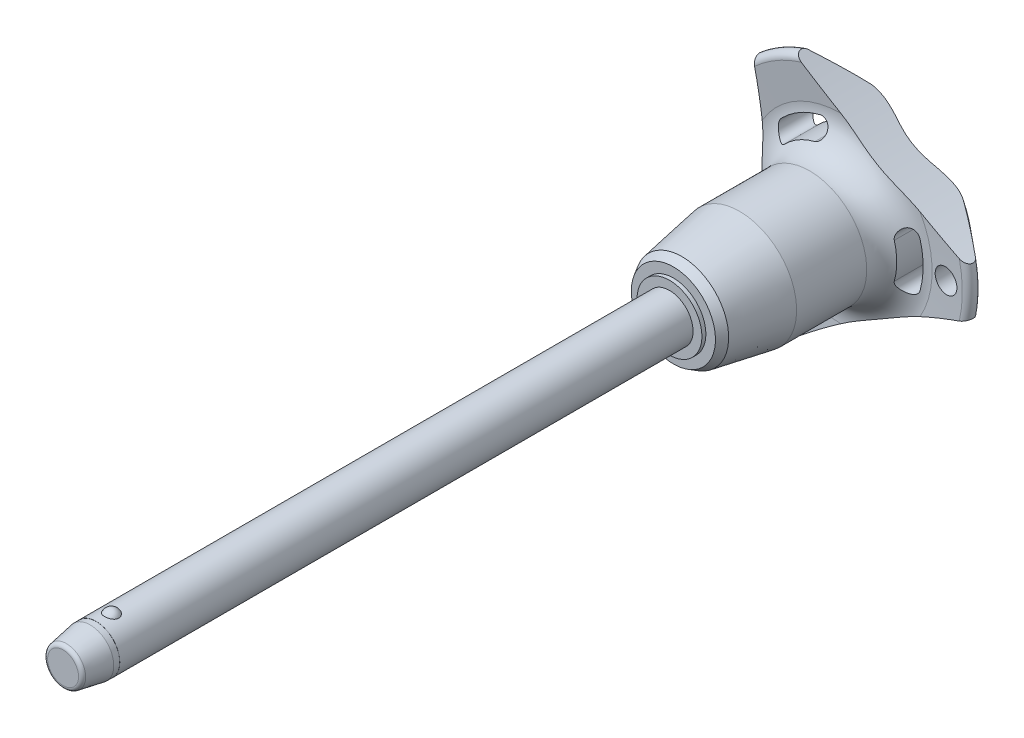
from build123d import *

# Parameters (mm, degrees)
SKETCH1_R           = 3
BOSS_EXTRUDE1_DEPTH = 70
SKETCH2_R           = 2.5
BOSS_EXTRUDE2_DEPTH = 26.7
BOSS_EXTRUDE3_START = 7
SKETCH1_2_R         = 3
BOSS_EXTRUDE3_DEPTH = 7
CHAMFER1_SIZE       = 3.5
CHAMFER1_SIZE2      = 0.617144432
FILLET1_R           = 0.5
SKETCH6_R           = 79.96
CUT_EXTRUDE1_DEPTH  = 100.509565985
CIRPATTERN1_COUNT   = 3
SKETCH7_R           = 1.5
CUT_EXTRUDE2_DEPTH  = 100.35648861
SKETCH8_R           = 3
SKETCH8_R_2         = 2.99
CUT_EXTRUDE3_DEPTH  = 4.2


with BuildPart() as part:
    # Sketch1 → Boss-Extrude1 (new body)
    with BuildSketch(Plane.XY):
        Circle(SKETCH1_R)
    extrude(amount=-BOSS_EXTRUDE1_DEPTH)

    # Sketch2 → Boss-Extrude2 (add)
    with BuildSketch(Plane(origin=(0, 0, -70), x_dir=(-1, 0, 0), z_dir=(0, 0, -1))):
        Circle(SKETCH2_R)
    extrude(amount=BOSS_EXTRUDE2_DEPTH)

    # Sketch3 → Revolve1 (revolve)
    with BuildSketch(Plane(origin=(0, 0, 0), x_dir=(0, 0, -1), z_dir=(1, 0, 0))):
        with BuildLine():
            Line((-0.866025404, 3.5), (-0.866025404, 1.5))
            ThreePointArc((-0.866025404, 1.5), (0.133974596, 2.5), (-0.866025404, 3.5))
        make_face()
        with BuildLine():
            Line((-0.866025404, -1.5), (-0.866025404, -3.5))
            ThreePointArc((-0.866025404, -3.5), (0.133974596, -2.5), (-0.866025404, -1.5))
        make_face()
    revolve(axis=Axis((0, -1.5, 0.866025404), (0, 1, 0)))

    # Sketch1_2 → Boss-Extrude3 (add)
    with BuildSketch(Plane.XY.offset(BOSS_EXTRUDE3_START)):
        Circle(SKETCH1_2_R)
    extrude(amount=-BOSS_EXTRUDE3_DEPTH)

    # Chamfer1
    chamfer1_edges = [part.edges().sort_by_distance(p)[0] for p in [
        (-3, 0, 7),
    ]]
    chamfer1_side = [part.faces().sort_by_distance(p)[0] for p in [
        (-3, 0, -31.5),
    ]]
    chamfer(chamfer1_edges, length=CHAMFER1_SIZE, length2=CHAMFER1_SIZE2, reference=chamfer1_side[0])

    # Fillet1
    fillet1_edges = [part.edges().sort_by_distance(p)[0] for p in [
        (-2.382855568, 0, 7),
        (2.5, 0, -96.7),
    ]]
    fillet(fillet1_edges, radius=FILLET1_R)

    # Sketch4 → Revolve2 (revolve)
    with BuildSketch(Plane(origin=(0, 0, 0), x_dir=(0, 0, -1), z_dir=(1, 0, 0)), mode=Mode.PRIVATE) as revolve2_sk:
        Polygon((70, 0), (70, 4.118359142), (70.5, 4.118359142), (70.5, 5.343400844), (71.560917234, 5.955921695), (78.9, 7.25), (87.8, 7.25), (87.8, 0), align=None)
    revolve(revolve2_sk.sketch.rotate(Axis((0, 0, -87.8), (0, 0, 1)), 90), axis=Axis((0, 0, -87.8), (0, 0, 1)))

    # Sketch5 → Revolve3 (revolve)
    with BuildSketch(Plane(origin=(0, 0, 0), x_dir=(0, 0, -1), z_dir=(1, 0, 0)), mode=Mode.PRIVATE) as revolve3_sk:
        with BuildLine():
            Line((91.78715932, 11.570250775), (91.452568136, 15.735949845))
            ThreePointArc((91.452568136, 15.735949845), (91.946485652, 16.540188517), (92.862835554, 16.314230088))
            Line((92.862835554, 16.314230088), (96.326414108, 12.186497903))
            ThreePointArc((96.326414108, 12.186497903), (96.7, 11.109282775), (96.261488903, 10.056825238))
            ThreePointArc((96.261488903, 10.056825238), (93.289873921, 5.413681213), (92.25, 0))
            Line((92.25, 0), (87.8, 0))
            Line((87.8, 0), (87.8, 7.25))
            ThreePointArc((87.8, 7.25), (90.739473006, 8.537160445), (91.78715932, 11.570250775))
        make_face()
    revolve(revolve3_sk.sketch.rotate(Axis((0, 0, -92.25), (0, 0, 1)), 90), axis=Axis((0, 0, -92.25), (0, 0, 1)))

    # Sketch6 → Cut-Extrude1 (cut, through all)
    with BuildSketch(Plane.XY):
        with Locations((-89.76, 0)):
            Circle(SKETCH6_R)
        with BuildLine():
            ThreePointArc((10.099921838, -2.834717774), (10.490188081, 0), (10.099921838, 2.834717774))
            ThreePointArc((10.099921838, 2.834717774), (8.768180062, 3.582738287), (8.020159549, 2.250996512))
            ThreePointArc((8.020159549, 2.250996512), (8.330062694, 0), (8.020159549, -2.250996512))
            ThreePointArc((8.020159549, -2.250996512), (8.768180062, -3.582738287), (10.099921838, -2.834717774))
        make_face()
    cut_extrude1 = extrude(amount=-CUT_EXTRUDE1_DEPTH, mode=Mode.SUBTRACT)

    # CirPattern1: Cut-Extrude1 ×3 about axis
    cirpattern1_axis = Axis((0, 0, 0), (0, 0, 1))
    for i in range(1, CIRPATTERN1_COUNT):
        add(cut_extrude1.rotate(cirpattern1_axis, i * 360 / CIRPATTERN1_COUNT), mode=Mode.SUBTRACT)

    # Sketch7 → Cut-Extrude2 (cut, through all)
    with BuildSketch(Plane.XY):
        with Locations(Location((13.490188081, 0, 0), (0, 0, 225.221865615))):
            Circle(SKETCH7_R)
    extrude(amount=-CUT_EXTRUDE2_DEPTH, mode=Mode.SUBTRACT)

    # Sketch8 → Cut-Extrude3 (cut)
    with BuildSketch(Plane.XY.offset(7)):
        Circle(SKETCH8_R)
        Circle(SKETCH8_R_2, mode=Mode.SUBTRACT)
    extrude(amount=-CUT_EXTRUDE3_DEPTH, mode=Mode.SUBTRACT)


solid = part.part
